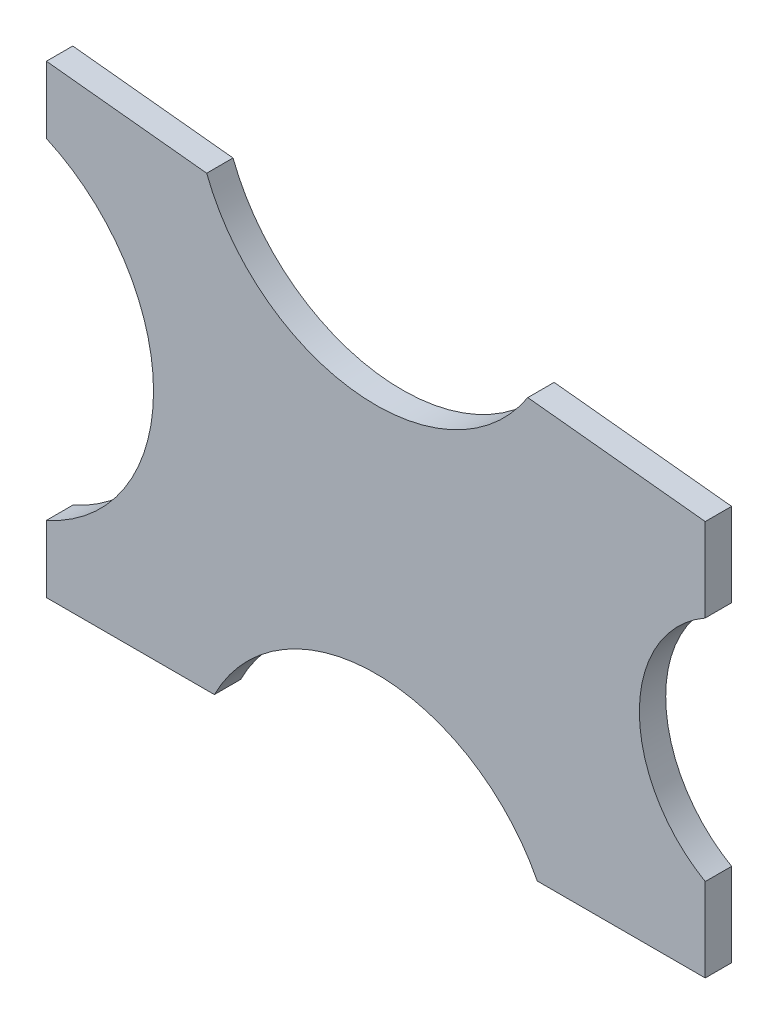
ISO-10303-21;
HEADER;
FILE_DESCRIPTION(('STEP AP214'),'2;1');
FILE_NAME('part.step','',(''),(''),'','','');
FILE_SCHEMA(('AUTOMOTIVE_DESIGN { 1 0 10303 214 1 1 1 1 }'));
ENDSEC;
DATA;
#1=APPLICATION_CONTEXT('core data for automotive mechanical design processes');
#2=APPLICATION_PROTOCOL_DEFINITION('international standard','automotive_design',2000,#1);
#3=PRODUCT_CONTEXT('',#1,'mechanical');
#4=PRODUCT('Part','Part','',(#3));
#5=PRODUCT_RELATED_PRODUCT_CATEGORY('part','',(#4));
#6=PRODUCT_DEFINITION_FORMATION('','',#4);
#7=PRODUCT_DEFINITION_CONTEXT('part definition',#1,'design');
#8=PRODUCT_DEFINITION('design','',#6,#7);
#9=PRODUCT_DEFINITION_SHAPE('','',#8);
#10=(LENGTH_UNIT() NAMED_UNIT(*) SI_UNIT(.MILLI.,.METRE.));
#11=(NAMED_UNIT(*) PLANE_ANGLE_UNIT() SI_UNIT($,.RADIAN.));
#12=(NAMED_UNIT(*) SI_UNIT($,.STERADIAN.) SOLID_ANGLE_UNIT());
#13=UNCERTAINTY_MEASURE_WITH_UNIT(LENGTH_MEASURE(1.E-05),#10,'distance_accuracy_value','');
#14=(GEOMETRIC_REPRESENTATION_CONTEXT(3) GLOBAL_UNCERTAINTY_ASSIGNED_CONTEXT((#13)) GLOBAL_UNIT_ASSIGNED_CONTEXT((#10,
#11,#12)) REPRESENTATION_CONTEXT('',''));
#15=CARTESIAN_POINT('',(0.,0.,0.));
#16=DIRECTION('',(0.,0.,1.));
#17=DIRECTION('',(1.,0.,0.));
#18=AXIS2_PLACEMENT_3D('',#15,#16,#17);
#19=CARTESIAN_POINT('',(-63.5,6.44979409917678,2.54));
#20=DIRECTION('',(1.,0.,0.));
#21=DIRECTION('',(0.,1.,0.));
#22=AXIS2_PLACEMENT_3D('',#19,#20,#21);
#23=PLANE('',#22);
#24=DIRECTION('',(0.,-1.,0.));
#25=VECTOR('',#24,1.);
#26=CARTESIAN_POINT('',(-63.5,6.44979409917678,0.));
#27=LINE('',#26,#25);
#28=CARTESIAN_POINT('',(-63.5,6.44979409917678,0.));
#29=VERTEX_POINT('',#28);
#30=CARTESIAN_POINT('',(-63.5,0.,0.));
#31=VERTEX_POINT('',#30);
#32=EDGE_CURVE('E153',#29,#31,#27,.T.);
#33=ORIENTED_EDGE('',*,*,#32,.T.);
#34=DIRECTION('',(0.,0.,-1.));
#35=VECTOR('',#34,1.);
#36=CARTESIAN_POINT('',(-63.5,0.,2.54));
#37=LINE('',#36,#35);
#38=CARTESIAN_POINT('',(-63.5,0.,2.54));
#39=VERTEX_POINT('',#38);
#40=EDGE_CURVE('E11',#39,#31,#37,.T.);
#41=ORIENTED_EDGE('',*,*,#40,.F.);
#42=DIRECTION('',(0.,-1.,0.));
#43=VECTOR('',#42,1.);
#44=CARTESIAN_POINT('',(-63.5,6.44979409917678,2.54));
#45=LINE('',#44,#43);
#46=CARTESIAN_POINT('',(-63.5,6.44979409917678,2.54));
#47=VERTEX_POINT('',#46);
#48=EDGE_CURVE('E175',#47,#39,#45,.T.);
#49=ORIENTED_EDGE('',*,*,#48,.F.);
#50=DIRECTION('',(0.,0.,-1.));
#51=VECTOR('',#50,1.);
#52=CARTESIAN_POINT('',(-63.5,6.44979409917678,2.54));
#53=LINE('',#52,#51);
#54=EDGE_CURVE('E149',#47,#29,#53,.T.);
#55=ORIENTED_EDGE('',*,*,#54,.T.);
#56=EDGE_LOOP('',(#33,#41,#49,#55));
#57=FACE_BOUND('',#56,.T.);
#58=ADVANCED_FACE('F33',(#57),#23,.F.);
#59=CARTESIAN_POINT('',(-63.5,0.,2.54));
#60=DIRECTION('',(0.,1.,0.));
#61=DIRECTION('',(0.,0.,1.));
#62=AXIS2_PLACEMENT_3D('',#59,#60,#61);
#63=PLANE('',#62);
#64=DIRECTION('',(1.,0.,0.));
#65=VECTOR('',#64,1.);
#66=CARTESIAN_POINT('',(-63.5,0.,0.));
#67=LINE('',#66,#65);
#68=CARTESIAN_POINT('',(-47.3107342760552,0.,0.));
#69=VERTEX_POINT('',#68);
#70=EDGE_CURVE('E156',#31,#69,#67,.T.);
#71=ORIENTED_EDGE('',*,*,#70,.T.);
#72=DIRECTION('',(0.,0.,-1.));
#73=VECTOR('',#72,1.);
#74=CARTESIAN_POINT('',(-47.3107342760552,0.,2.54));
#75=LINE('',#74,#73);
#76=CARTESIAN_POINT('',(-47.3107342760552,0.,2.54));
#77=VERTEX_POINT('',#76);
#78=EDGE_CURVE('E41',#77,#69,#75,.T.);
#79=ORIENTED_EDGE('',*,*,#78,.F.);
#80=DIRECTION('',(1.,0.,0.));
#81=VECTOR('',#80,1.);
#82=CARTESIAN_POINT('',(-63.5,0.,2.54));
#83=LINE('',#82,#81);
#84=EDGE_CURVE('E104',#39,#77,#83,.T.);
#85=ORIENTED_EDGE('',*,*,#84,.F.);
#86=ORIENTED_EDGE('',*,*,#40,.T.);
#87=EDGE_LOOP('',(#71,#79,#85,#86));
#88=FACE_BOUND('',#87,.T.);
#89=ADVANCED_FACE('F253',(#88),#63,.F.);
#90=CARTESIAN_POINT('',(-31.75,-7.9248,2.54));
#91=DIRECTION('',(0.,0.,-1.));
#92=DIRECTION('',(-1.,0.,0.));
#93=AXIS2_PLACEMENT_3D('',#90,#91,#92);
#94=CYLINDRICAL_SURFACE('',#93,17.4625);
#95=CARTESIAN_POINT('',(-31.75,-7.9248,0.));
#96=DIRECTION('',(0.,0.,-1.));
#97=DIRECTION('',(1.,0.,0.));
#98=AXIS2_PLACEMENT_3D('',#95,#96,#97);
#99=CIRCLE('',#98,17.4625);
#100=CARTESIAN_POINT('',(-16.1892657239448,0.,0.));
#101=VERTEX_POINT('',#100);
#102=EDGE_CURVE('E158',#69,#101,#99,.T.);
#103=ORIENTED_EDGE('',*,*,#102,.T.);
#104=DIRECTION('',(0.,0.,-1.));
#105=VECTOR('',#104,1.);
#106=CARTESIAN_POINT('',(-16.1892657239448,0.,2.54));
#107=LINE('',#106,#105);
#108=CARTESIAN_POINT('',(-16.1892657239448,0.,2.54));
#109=VERTEX_POINT('',#108);
#110=EDGE_CURVE('E194',#109,#101,#107,.T.);
#111=ORIENTED_EDGE('',*,*,#110,.F.);
#112=CARTESIAN_POINT('',(-31.75,-7.9248,2.54));
#113=DIRECTION('',(0.,0.,-1.));
#114=DIRECTION('',(1.,0.,0.));
#115=AXIS2_PLACEMENT_3D('',#112,#113,#114);
#116=CIRCLE('',#115,17.4625);
#117=EDGE_CURVE('E202',#77,#109,#116,.T.);
#118=ORIENTED_EDGE('',*,*,#117,.F.);
#119=ORIENTED_EDGE('',*,*,#78,.T.);
#120=EDGE_LOOP('',(#103,#111,#118,#119));
#121=FACE_BOUND('',#120,.T.);
#122=ADVANCED_FACE('F200',(#121),#94,.F.);
#123=CARTESIAN_POINT('',(-16.1892657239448,0.,2.54));
#124=DIRECTION('',(0.,1.,0.));
#125=DIRECTION('',(-1.,0.,0.));
#126=AXIS2_PLACEMENT_3D('',#123,#124,#125);
#127=PLANE('',#126);
#128=DIRECTION('',(1.,0.,0.));
#129=VECTOR('',#128,1.);
#130=CARTESIAN_POINT('',(-16.1892657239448,0.,0.));
#131=LINE('',#130,#129);
#132=CARTESIAN_POINT('',(0.,0.,0.));
#133=VERTEX_POINT('',#132);
#134=EDGE_CURVE('E160',#101,#133,#131,.T.);
#135=ORIENTED_EDGE('',*,*,#134,.T.);
#136=DIRECTION('',(0.,0.,-1.));
#137=VECTOR('',#136,1.);
#138=CARTESIAN_POINT('',(0.,0.,2.54));
#139=LINE('',#138,#137);
#140=CARTESIAN_POINT('',(0.,0.,2.54));
#141=VERTEX_POINT('',#140);
#142=EDGE_CURVE('E191',#141,#133,#139,.T.);
#143=ORIENTED_EDGE('',*,*,#142,.F.);
#144=DIRECTION('',(1.,0.,0.));
#145=VECTOR('',#144,1.);
#146=CARTESIAN_POINT('',(-16.1892657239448,0.,2.54));
#147=LINE('',#146,#145);
#148=EDGE_CURVE('E220',#109,#141,#147,.T.);
#149=ORIENTED_EDGE('',*,*,#148,.F.);
#150=ORIENTED_EDGE('',*,*,#110,.T.);
#151=EDGE_LOOP('',(#135,#143,#149,#150));
#152=FACE_BOUND('',#151,.T.);
#153=ADVANCED_FACE('F211',(#152),#127,.F.);
#154=CARTESIAN_POINT('',(0.,0.,2.54));
#155=DIRECTION('',(-1.,0.,0.));
#156=DIRECTION('',(0.,0.,1.));
#157=AXIS2_PLACEMENT_3D('',#154,#155,#156);
#158=PLANE('',#157);
#159=DIRECTION('',(0.,1.,0.));
#160=VECTOR('',#159,1.);
#161=CARTESIAN_POINT('',(0.,0.,0.));
#162=LINE('',#161,#160);
#163=CARTESIAN_POINT('',(0.,8.05147737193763,0.));
#164=VERTEX_POINT('',#163);
#165=EDGE_CURVE('E162',#133,#164,#162,.T.);
#166=ORIENTED_EDGE('',*,*,#165,.T.);
#167=DIRECTION('',(0.,0.,-1.));
#168=VECTOR('',#167,1.);
#169=CARTESIAN_POINT('',(0.,8.05147737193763,2.54));
#170=LINE('',#169,#168);
#171=CARTESIAN_POINT('',(0.,8.05147737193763,2.54));
#172=VERTEX_POINT('',#171);
#173=EDGE_CURVE('E188',#172,#164,#170,.T.);
#174=ORIENTED_EDGE('',*,*,#173,.F.);
#175=DIRECTION('',(0.,1.,0.));
#176=VECTOR('',#175,1.);
#177=CARTESIAN_POINT('',(0.,0.,2.54));
#178=LINE('',#177,#176);
#179=EDGE_CURVE('E217',#141,#172,#178,.T.);
#180=ORIENTED_EDGE('',*,*,#179,.F.);
#181=ORIENTED_EDGE('',*,*,#142,.T.);
#182=EDGE_LOOP('',(#166,#174,#180,#181));
#183=FACE_BOUND('',#182,.T.);
#184=ADVANCED_FACE('F215',(#183),#158,.F.);
#185=CARTESIAN_POINT('',(6.35,19.05,2.54));
#186=DIRECTION('',(0.,0.,-1.));
#187=DIRECTION('',(-1.,0.,0.));
#188=AXIS2_PLACEMENT_3D('',#185,#186,#187);
#189=CYLINDRICAL_SURFACE('',#188,12.7);
#190=CARTESIAN_POINT('',(6.35,19.05,0.));
#191=DIRECTION('',(0.,0.,-1.));
#192=DIRECTION('',(1.,0.,0.));
#193=AXIS2_PLACEMENT_3D('',#190,#191,#192);
#194=CIRCLE('',#193,12.7);
#195=CARTESIAN_POINT('',(0.,30.0485226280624,0.));
#196=VERTEX_POINT('',#195);
#197=EDGE_CURVE('E164',#164,#196,#194,.T.);
#198=ORIENTED_EDGE('',*,*,#197,.T.);
#199=DIRECTION('',(0.,0.,-1.));
#200=VECTOR('',#199,1.);
#201=CARTESIAN_POINT('',(0.,30.0485226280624,2.54));
#202=LINE('',#201,#200);
#203=CARTESIAN_POINT('',(0.,30.0485226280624,2.54));
#204=VERTEX_POINT('',#203);
#205=EDGE_CURVE('E185',#204,#196,#202,.T.);
#206=ORIENTED_EDGE('',*,*,#205,.F.);
#207=CARTESIAN_POINT('',(6.35,19.05,2.54));
#208=DIRECTION('',(0.,0.,-1.));
#209=DIRECTION('',(1.,0.,0.));
#210=AXIS2_PLACEMENT_3D('',#207,#208,#209);
#211=CIRCLE('',#210,12.7);
#212=EDGE_CURVE('E219',#172,#204,#211,.T.);
#213=ORIENTED_EDGE('',*,*,#212,.F.);
#214=ORIENTED_EDGE('',*,*,#173,.T.);
#215=EDGE_LOOP('',(#198,#206,#213,#214));
#216=FACE_BOUND('',#215,.T.);
#217=ADVANCED_FACE('F266',(#216),#189,.F.);
#218=CARTESIAN_POINT('',(0.,30.0485226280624,2.54));
#219=DIRECTION('',(-1.,0.,0.));
#220=DIRECTION('',(0.,0.,1.));
#221=AXIS2_PLACEMENT_3D('',#218,#219,#220);
#222=PLANE('',#221);
#223=DIRECTION('',(0.,1.,0.));
#224=VECTOR('',#223,1.);
#225=CARTESIAN_POINT('',(0.,30.0485226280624,0.));
#226=LINE('',#225,#224);
#227=CARTESIAN_POINT('',(0.,38.1,0.));
#228=VERTEX_POINT('',#227);
#229=EDGE_CURVE('E166',#196,#228,#226,.T.);
#230=ORIENTED_EDGE('',*,*,#229,.T.);
#231=DIRECTION('',(0.,0.,-1.));
#232=VECTOR('',#231,1.);
#233=CARTESIAN_POINT('',(0.,38.1,2.54));
#234=LINE('',#233,#232);
#235=CARTESIAN_POINT('',(0.,38.1,2.54));
#236=VERTEX_POINT('',#235);
#237=EDGE_CURVE('E182',#236,#228,#234,.T.);
#238=ORIENTED_EDGE('',*,*,#237,.F.);
#239=DIRECTION('',(0.,1.,0.));
#240=VECTOR('',#239,1.);
#241=CARTESIAN_POINT('',(0.,30.0485226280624,2.54));
#242=LINE('',#241,#240);
#243=EDGE_CURVE('E222',#204,#236,#242,.T.);
#244=ORIENTED_EDGE('',*,*,#243,.F.);
#245=ORIENTED_EDGE('',*,*,#205,.T.);
#246=EDGE_LOOP('',(#230,#238,#244,#245));
#247=FACE_BOUND('',#246,.T.);
#248=ADVANCED_FACE('F269',(#247),#222,.F.);
#249=CARTESIAN_POINT('',(0.,38.1,2.54));
#250=DIRECTION('',(-0.104528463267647,-0.994521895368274,0.));
#251=DIRECTION('',(0.994521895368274,-0.104528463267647,0.));
#252=AXIS2_PLACEMENT_3D('',#249,#250,#251);
#253=PLANE('',#252);
#254=DIRECTION('',(-0.994521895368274,0.104528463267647,0.));
#255=VECTOR('',#254,1.);
#256=CARTESIAN_POINT('',(0.,38.1,0.));
#257=LINE('',#256,#255);
#258=CARTESIAN_POINT('',(-17.1028762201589,39.8975847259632,0.));
#259=VERTEX_POINT('',#258);
#260=EDGE_CURVE('E168',#228,#259,#257,.T.);
#261=ORIENTED_EDGE('',*,*,#260,.T.);
#262=DIRECTION('',(0.,0.,-1.));
#263=VECTOR('',#262,1.);
#264=CARTESIAN_POINT('',(-17.1028762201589,39.8975847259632,2.54));
#265=LINE('',#264,#263);
#266=CARTESIAN_POINT('',(-17.1028762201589,39.8975847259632,2.54));
#267=VERTEX_POINT('',#266);
#268=EDGE_CURVE('E179',#267,#259,#265,.T.);
#269=ORIENTED_EDGE('',*,*,#268,.F.);
#270=DIRECTION('',(-0.994521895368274,0.104528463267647,0.));
#271=VECTOR('',#270,1.);
#272=CARTESIAN_POINT('',(0.,38.1,2.54));
#273=LINE('',#272,#271);
#274=EDGE_CURVE('E228',#236,#267,#273,.T.);
#275=ORIENTED_EDGE('',*,*,#274,.F.);
#276=ORIENTED_EDGE('',*,*,#237,.T.);
#277=EDGE_LOOP('',(#261,#269,#275,#276));
#278=FACE_BOUND('',#277,.T.);
#279=ADVANCED_FACE('F234',(#278),#253,.F.);
#280=CARTESIAN_POINT('',(-31.75,49.4055114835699,2.54));
#281=DIRECTION('',(0.,0.,-1.));
#282=DIRECTION('',(-1.,0.,0.));
#283=AXIS2_PLACEMENT_3D('',#280,#281,#282);
#284=CYLINDRICAL_SURFACE('',#283,17.4625);
#285=CARTESIAN_POINT('',(-31.75,49.4055114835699,0.));
#286=DIRECTION('',(0.,0.,-1.));
#287=DIRECTION('',(1.,0.,0.));
#288=AXIS2_PLACEMENT_3D('',#285,#286,#287);
#289=CIRCLE('',#288,17.4625);
#290=CARTESIAN_POINT('',(-48.0538581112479,43.1506640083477,0.));
#291=VERTEX_POINT('',#290);
#292=EDGE_CURVE('E170',#259,#291,#289,.T.);
#293=ORIENTED_EDGE('',*,*,#292,.T.);
#294=DIRECTION('',(0.,0.,-1.));
#295=VECTOR('',#294,1.);
#296=CARTESIAN_POINT('',(-48.0538581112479,43.1506640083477,2.54));
#297=LINE('',#296,#295);
#298=CARTESIAN_POINT('',(-48.0538581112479,43.1506640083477,2.54));
#299=VERTEX_POINT('',#298);
#300=EDGE_CURVE('E144',#299,#291,#297,.T.);
#301=ORIENTED_EDGE('',*,*,#300,.F.);
#302=CARTESIAN_POINT('',(-31.75,49.4055114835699,2.54));
#303=DIRECTION('',(0.,0.,-1.));
#304=DIRECTION('',(1.,0.,0.));
#305=AXIS2_PLACEMENT_3D('',#302,#303,#304);
#306=CIRCLE('',#305,17.4625);
#307=EDGE_CURVE('E135',#267,#299,#306,.T.);
#308=ORIENTED_EDGE('',*,*,#307,.F.);
#309=ORIENTED_EDGE('',*,*,#268,.T.);
#310=EDGE_LOOP('',(#293,#301,#308,#309));
#311=FACE_BOUND('',#310,.T.);
#312=ADVANCED_FACE('F238',(#311),#284,.F.);
#313=CARTESIAN_POINT('',(-48.0538581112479,43.1506640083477,2.54));
#314=DIRECTION('',(-0.104528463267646,-0.994521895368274,0.));
#315=DIRECTION('',(0.994521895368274,-0.104528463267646,0.));
#316=AXIS2_PLACEMENT_3D('',#313,#314,#315);
#317=PLANE('',#316);
#318=DIRECTION('',(-0.994521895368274,0.104528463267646,0.));
#319=VECTOR('',#318,1.);
#320=CARTESIAN_POINT('',(-48.0538581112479,43.1506640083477,0.));
#321=LINE('',#320,#319);
#322=CARTESIAN_POINT('',(-63.5,44.77411893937,0.));
#323=VERTEX_POINT('',#322);
#324=EDGE_CURVE('E143',#291,#323,#321,.T.);
#325=ORIENTED_EDGE('',*,*,#324,.T.);
#326=DIRECTION('',(0.,0.,-1.));
#327=VECTOR('',#326,1.);
#328=CARTESIAN_POINT('',(-63.5,44.77411893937,2.54));
#329=LINE('',#328,#327);
#330=CARTESIAN_POINT('',(-63.5,44.77411893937,2.54));
#331=VERTEX_POINT('',#330);
#332=EDGE_CURVE('E140',#331,#323,#329,.T.);
#333=ORIENTED_EDGE('',*,*,#332,.F.);
#334=DIRECTION('',(-0.994521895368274,0.104528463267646,0.));
#335=VECTOR('',#334,1.);
#336=CARTESIAN_POINT('',(-48.0538581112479,43.1506640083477,2.54));
#337=LINE('',#336,#335);
#338=EDGE_CURVE('E129',#299,#331,#337,.T.);
#339=ORIENTED_EDGE('',*,*,#338,.F.);
#340=ORIENTED_EDGE('',*,*,#300,.T.);
#341=EDGE_LOOP('',(#325,#333,#339,#340));
#342=FACE_BOUND('',#341,.T.);
#343=ADVANCED_FACE('F141',(#342),#317,.F.);
#344=CARTESIAN_POINT('',(-63.5,44.77411893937,2.54));
#345=DIRECTION('',(1.,0.,0.));
#346=DIRECTION('',(0.,1.,0.));
#347=AXIS2_PLACEMENT_3D('',#344,#345,#346);
#348=PLANE('',#347);
#349=DIRECTION('',(0.,-1.,0.));
#350=VECTOR('',#349,1.);
#351=CARTESIAN_POINT('',(-63.5,44.77411893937,0.));
#352=LINE('',#351,#350);
#353=CARTESIAN_POINT('',(-63.5,38.3243248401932,0.));
#354=VERTEX_POINT('',#353);
#355=EDGE_CURVE('E90',#323,#354,#352,.T.);
#356=ORIENTED_EDGE('',*,*,#355,.T.);
#357=DIRECTION('',(0.,0.,-1.));
#358=VECTOR('',#357,1.);
#359=CARTESIAN_POINT('',(-63.5,38.3243248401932,2.54));
#360=LINE('',#359,#358);
#361=CARTESIAN_POINT('',(-63.5,38.3243248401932,2.54));
#362=VERTEX_POINT('',#361);
#363=EDGE_CURVE('E145',#362,#354,#360,.T.);
#364=ORIENTED_EDGE('',*,*,#363,.F.);
#365=DIRECTION('',(0.,-1.,0.));
#366=VECTOR('',#365,1.);
#367=CARTESIAN_POINT('',(-63.5,44.77411893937,2.54));
#368=LINE('',#367,#366);
#369=EDGE_CURVE('E133',#331,#362,#368,.T.);
#370=ORIENTED_EDGE('',*,*,#369,.F.);
#371=ORIENTED_EDGE('',*,*,#332,.T.);
#372=EDGE_LOOP('',(#356,#364,#370,#371));
#373=FACE_BOUND('',#372,.T.);
#374=ADVANCED_FACE('F147',(#373),#348,.F.);
#375=CARTESIAN_POINT('',(-70.6374,22.387059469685,2.54));
#376=DIRECTION('',(0.,0.,-1.));
#377=DIRECTION('',(-1.,0.,0.));
#378=AXIS2_PLACEMENT_3D('',#375,#376,#377);
#379=CYLINDRICAL_SURFACE('',#378,17.4625);
#380=CARTESIAN_POINT('',(-70.6374,22.387059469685,0.));
#381=DIRECTION('',(0.,0.,-1.));
#382=DIRECTION('',(1.,0.,0.));
#383=AXIS2_PLACEMENT_3D('',#380,#381,#382);
#384=CIRCLE('',#383,17.4625);
#385=EDGE_CURVE('E96',#354,#29,#384,.T.);
#386=ORIENTED_EDGE('',*,*,#385,.T.);
#387=ORIENTED_EDGE('',*,*,#54,.F.);
#388=CARTESIAN_POINT('',(-70.6374,22.387059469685,2.54));
#389=DIRECTION('',(0.,0.,-1.));
#390=DIRECTION('',(1.,0.,0.));
#391=AXIS2_PLACEMENT_3D('',#388,#389,#390);
#392=CIRCLE('',#391,17.4625);
#393=EDGE_CURVE('E49',#362,#47,#392,.T.);
#394=ORIENTED_EDGE('',*,*,#393,.F.);
#395=ORIENTED_EDGE('',*,*,#363,.T.);
#396=EDGE_LOOP('',(#386,#387,#394,#395));
#397=FACE_BOUND('',#396,.T.);
#398=ADVANCED_FACE('F242',(#397),#379,.F.);
#399=CARTESIAN_POINT('',(-31.75,-7.9248,2.54));
#400=DIRECTION('',(0.,0.,1.));
#401=DIRECTION('',(1.,0.,0.));
#402=AXIS2_PLACEMENT_3D('',#399,#400,#401);
#403=PLANE('',#402);
#404=ORIENTED_EDGE('',*,*,#48,.T.);
#405=ORIENTED_EDGE('',*,*,#84,.T.);
#406=ORIENTED_EDGE('',*,*,#117,.T.);
#407=ORIENTED_EDGE('',*,*,#148,.T.);
#408=ORIENTED_EDGE('',*,*,#179,.T.);
#409=ORIENTED_EDGE('',*,*,#212,.T.);
#410=ORIENTED_EDGE('',*,*,#243,.T.);
#411=ORIENTED_EDGE('',*,*,#274,.T.);
#412=ORIENTED_EDGE('',*,*,#307,.T.);
#413=ORIENTED_EDGE('',*,*,#338,.T.);
#414=ORIENTED_EDGE('',*,*,#369,.T.);
#415=ORIENTED_EDGE('',*,*,#393,.T.);
#416=EDGE_LOOP('',(#404,#405,#406,#407,#408,#409,#410,#411,#412,#413,#414,#415));
#417=FACE_BOUND('',#416,.T.);
#418=ADVANCED_FACE('F131',(#417),#403,.T.);
#419=CARTESIAN_POINT('',(-31.75,-7.9248,0.));
#420=DIRECTION('',(0.,0.,1.));
#421=DIRECTION('',(1.,0.,0.));
#422=AXIS2_PLACEMENT_3D('',#419,#420,#421);
#423=PLANE('',#422);
#424=ORIENTED_EDGE('',*,*,#32,.F.);
#425=ORIENTED_EDGE('',*,*,#385,.F.);
#426=ORIENTED_EDGE('',*,*,#355,.F.);
#427=ORIENTED_EDGE('',*,*,#324,.F.);
#428=ORIENTED_EDGE('',*,*,#292,.F.);
#429=ORIENTED_EDGE('',*,*,#260,.F.);
#430=ORIENTED_EDGE('',*,*,#229,.F.);
#431=ORIENTED_EDGE('',*,*,#197,.F.);
#432=ORIENTED_EDGE('',*,*,#165,.F.);
#433=ORIENTED_EDGE('',*,*,#134,.F.);
#434=ORIENTED_EDGE('',*,*,#102,.F.);
#435=ORIENTED_EDGE('',*,*,#70,.F.);
#436=EDGE_LOOP('',(#424,#425,#426,#427,#428,#429,#430,#431,#432,#433,#434,#435));
#437=FACE_BOUND('',#436,.T.);
#438=ADVANCED_FACE('F206',(#437),#423,.F.);
#439=CLOSED_SHELL('',(#58,#89,#122,#153,#184,#217,#248,#279,#312,#343,#374,#398,#418,#438));
#440=MANIFOLD_SOLID_BREP('B2',#439);
#441=ADVANCED_BREP_SHAPE_REPRESENTATION('',(#18,#440),#14);
#442=SHAPE_DEFINITION_REPRESENTATION(#9,#441);
ENDSEC;
END-ISO-10303-21;
